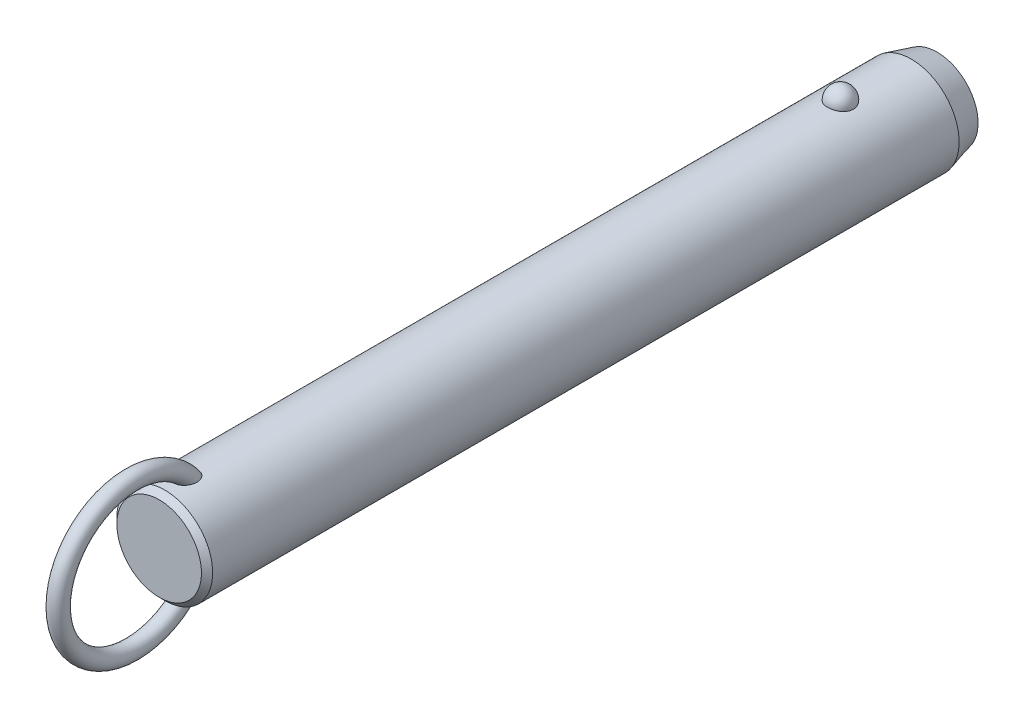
ISO-10303-21;
HEADER;
FILE_DESCRIPTION(('STEP AP214'),'2;1');
FILE_NAME('part.step','',(''),(''),'','','');
FILE_SCHEMA(('AUTOMOTIVE_DESIGN { 1 0 10303 214 1 1 1 1 }'));
ENDSEC;
DATA;
#1=APPLICATION_CONTEXT('core data for automotive mechanical design processes');
#2=APPLICATION_PROTOCOL_DEFINITION('international standard','automotive_design',2000,#1);
#3=PRODUCT_CONTEXT('',#1,'mechanical');
#4=PRODUCT('Part','Part','',(#3));
#5=PRODUCT_RELATED_PRODUCT_CATEGORY('part','',(#4));
#6=PRODUCT_DEFINITION_FORMATION('','',#4);
#7=PRODUCT_DEFINITION_CONTEXT('part definition',#1,'design');
#8=PRODUCT_DEFINITION('design','',#6,#7);
#9=PRODUCT_DEFINITION_SHAPE('','',#8);
#10=(LENGTH_UNIT() NAMED_UNIT(*) SI_UNIT(.MILLI.,.METRE.));
#11=(NAMED_UNIT(*) PLANE_ANGLE_UNIT() SI_UNIT($,.RADIAN.));
#12=(NAMED_UNIT(*) SI_UNIT($,.STERADIAN.) SOLID_ANGLE_UNIT());
#13=UNCERTAINTY_MEASURE_WITH_UNIT(LENGTH_MEASURE(1.E-05),#10,'distance_accuracy_value','');
#14=(GEOMETRIC_REPRESENTATION_CONTEXT(3) GLOBAL_UNCERTAINTY_ASSIGNED_CONTEXT((#13)) GLOBAL_UNIT_ASSIGNED_CONTEXT((#10,
#11,#12)) REPRESENTATION_CONTEXT('',''));
#15=CARTESIAN_POINT('',(0.,0.,0.));
#16=DIRECTION('',(0.,0.,1.));
#17=DIRECTION('',(1.,0.,0.));
#18=AXIS2_PLACEMENT_3D('',#15,#16,#17);
#19=CARTESIAN_POINT('',(0.,0.,142.2));
#20=DIRECTION('',(0.,0.,-1.));
#21=DIRECTION('',(-1.,0.,0.));
#22=AXIS2_PLACEMENT_3D('',#19,#20,#21);
#23=CYLINDRICAL_SURFACE('',#22,11.1);
#24=CARTESIAN_POINT('',(2.9724815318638,10.6945945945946,-3.));
#25=CARTESIAN_POINT('',(2.97247830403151,10.6945972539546,-2.83225059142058));
#26=CARTESIAN_POINT('',(2.95876598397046,10.6984356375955,-2.66445972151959));
#27=CARTESIAN_POINT('',(2.90424529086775,10.7133624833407,-2.33362381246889));
#28=CARTESIAN_POINT('',(2.8634252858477,10.7244540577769,-2.1705808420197));
#29=CARTESIAN_POINT('',(2.75573657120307,10.7526272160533,-1.85396767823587));
#30=CARTESIAN_POINT('',(2.68887937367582,10.7697061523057,-1.70039333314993));
#31=CARTESIAN_POINT('',(2.53079696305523,10.8079438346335,-1.40691598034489));
#32=CARTESIAN_POINT('',(2.43957264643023,10.8291024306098,-1.2670124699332));
#33=CARTESIAN_POINT('',(2.23458150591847,10.8732541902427,-1.00409565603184));
#34=CARTESIAN_POINT('',(2.12071295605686,10.8962553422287,-0.881162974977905));
#35=CARTESIAN_POINT('',(1.87365402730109,10.9414421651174,-0.656352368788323));
#36=CARTESIAN_POINT('',(1.74046358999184,10.9636278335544,-0.554474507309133));
#37=CARTESIAN_POINT('',(1.45872188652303,11.0046495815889,-0.374872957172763));
#38=CARTESIAN_POINT('',(1.31021276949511,11.0234944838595,-0.297085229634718));
#39=CARTESIAN_POINT('',(1.00170030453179,11.0557957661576,-0.167529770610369));
#40=CARTESIAN_POINT('',(0.841698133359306,11.0692526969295,-0.115759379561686));
#41=CARTESIAN_POINT('',(0.517607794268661,11.0890932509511,-0.0403925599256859));
#42=CARTESIAN_POINT('',(0.353633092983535,11.0955916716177,-0.0163383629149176));
#43=CARTESIAN_POINT('',(0.0238420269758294,11.1011989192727,0.0044517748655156));
#44=CARTESIAN_POINT('',(-0.141974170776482,11.1003084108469,0.00119017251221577));
#45=CARTESIAN_POINT('',(-0.468405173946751,11.0912990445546,-0.0323233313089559));
#46=CARTESIAN_POINT('',(-0.629059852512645,11.0832767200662,-0.0622147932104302));
#47=CARTESIAN_POINT('',(-0.942937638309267,11.0609962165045,-0.147645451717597));
#48=CARTESIAN_POINT('',(-1.09616062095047,11.0467379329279,-0.203185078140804));
#49=CARTESIAN_POINT('',(-1.39181061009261,11.0134071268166,-0.3387529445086));
#50=CARTESIAN_POINT('',(-1.53417383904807,10.9943086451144,-0.418913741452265));
#51=CARTESIAN_POINT('',(-1.80342160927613,10.9533667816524,-0.60144882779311));
#52=CARTESIAN_POINT('',(-1.9303046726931,10.9315231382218,-0.703825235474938));
#53=CARTESIAN_POINT('',(-2.16747598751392,10.887005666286,-0.930091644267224));
#54=CARTESIAN_POINT('',(-2.27742774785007,10.8643239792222,-1.05433291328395));
#55=CARTESIAN_POINT('',(-2.47517316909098,10.8209886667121,-1.31966633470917));
#56=CARTESIAN_POINT('',(-2.56296538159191,10.8003351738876,-1.46075958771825));
#57=CARTESIAN_POINT('',(-2.71500300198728,10.7631304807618,-1.75753646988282));
#58=CARTESIAN_POINT('',(-2.77898901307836,10.7466250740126,-1.91335887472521));
#59=CARTESIAN_POINT('',(-2.88046189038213,10.7198747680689,-2.2339152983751));
#60=CARTESIAN_POINT('',(-2.91794947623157,10.709629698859,-2.39864907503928));
#61=CARTESIAN_POINT('',(-2.96537819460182,10.6965949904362,-2.73165170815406));
#62=CARTESIAN_POINT('',(-2.97542891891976,10.693775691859,-2.89990378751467));
#63=CARTESIAN_POINT('',(-2.96804271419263,10.6958279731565,-3.235752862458));
#64=CARTESIAN_POINT('',(-2.95060646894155,10.7006993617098,-3.40334987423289));
#65=CARTESIAN_POINT('',(-2.88883358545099,10.71753912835,-3.73233906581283));
#66=CARTESIAN_POINT('',(-2.84462026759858,10.7294749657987,-3.89375610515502));
#67=CARTESIAN_POINT('',(-2.73050447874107,10.7590797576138,-4.20667949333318));
#68=CARTESIAN_POINT('',(-2.66060103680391,10.7767489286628,-4.35818546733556));
#69=CARTESIAN_POINT('',(-2.49642559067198,10.8159599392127,-4.6478542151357));
#70=CARTESIAN_POINT('',(-2.40203047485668,10.8375211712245,-4.78594458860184));
#71=CARTESIAN_POINT('',(-2.19143488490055,10.8820570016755,-5.0441038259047));
#72=CARTESIAN_POINT('',(-2.07523364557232,10.9050316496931,-5.16417205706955));
#73=CARTESIAN_POINT('',(-1.82361254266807,10.9499219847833,-5.38334833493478));
#74=CARTESIAN_POINT('',(-1.68812945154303,10.9718338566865,-5.48238464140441));
#75=CARTESIAN_POINT('',(-1.40191298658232,11.0120611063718,-5.65618873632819));
#76=CARTESIAN_POINT('',(-1.25118062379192,11.0303767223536,-5.73095813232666));
#77=CARTESIAN_POINT('',(-0.940570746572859,11.0611653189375,-5.85334725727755));
#78=CARTESIAN_POINT('',(-0.780821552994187,11.0737044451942,-5.90127578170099));
#79=CARTESIAN_POINT('',(-0.455204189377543,11.0918598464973,-5.96992976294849));
#80=CARTESIAN_POINT('',(-0.289336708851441,11.0974768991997,-5.99065827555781));
#81=CARTESIAN_POINT('',(0.0406846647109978,11.1011307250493,-6.00418773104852));
#82=CARTESIAN_POINT('',(0.204817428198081,11.099299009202,-5.99747318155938));
#83=CARTESIAN_POINT('',(0.5295530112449,11.088551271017,-5.9574031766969));
#84=CARTESIAN_POINT('',(0.69015594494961,11.0796354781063,-5.92404858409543));
#85=CARTESIAN_POINT('',(1.0027760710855,11.0557204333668,-5.83180084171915));
#86=CARTESIAN_POINT('',(1.15482001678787,11.0407414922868,-5.77299291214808));
#87=CARTESIAN_POINT('',(1.44678373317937,11.0062913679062,-5.63147366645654));
#88=CARTESIAN_POINT('',(1.58670279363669,10.9868199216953,-5.54876095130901));
#89=CARTESIAN_POINT('',(1.8527023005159,10.9451315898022,-5.36027644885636));
#90=CARTESIAN_POINT('',(1.97855158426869,10.9228788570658,-5.25418644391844));
#91=CARTESIAN_POINT('',(2.21080872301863,10.8782509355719,-5.02251354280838));
#92=CARTESIAN_POINT('',(2.31721312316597,10.8558757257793,-4.89692718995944));
#93=CARTESIAN_POINT('',(2.5094551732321,10.8130715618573,-4.62745408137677));
#94=CARTESIAN_POINT('',(2.59493284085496,10.7926798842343,-4.48330448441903));
#95=CARTESIAN_POINT('',(2.740862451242,10.7565495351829,-4.18236358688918));
#96=CARTESIAN_POINT('',(2.80132490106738,10.7408089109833,-4.02557762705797));
#97=CARTESIAN_POINT('',(2.88959070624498,10.7173718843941,-3.72475308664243));
#98=CARTESIAN_POINT('',(2.92062102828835,10.7088950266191,-3.58171216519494));
#99=CARTESIAN_POINT('',(2.96206765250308,10.6975052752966,-3.29245795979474));
#100=CARTESIAN_POINT('',(2.97248434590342,10.6945922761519,-3.14624473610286));
#101=CARTESIAN_POINT('',(2.9724815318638,10.6945945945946,-3.));
#102=B_SPLINE_CURVE_WITH_KNOTS('',3,(#24,#25,#26,#27,#28,#29,#30,#31,#32,#33,#34,#35,#36,#37,
#38,#39,#40,#41,#42,#43,#44,#45,#46,#47,#48,#49,#50,#51,#52,#53,#54,#55,#56,#57,#58,#59,#60,#61,
#62,#63,#64,#65,#66,#67,#68,#69,#70,#71,#72,#73,#74,#75,#76,#77,#78,#79,#80,#81,#82,#83,#84,#85,
#86,#87,#88,#89,#90,#91,#92,#93,#94,#95,#96,#97,#98,#99,#100,#101),.UNSPECIFIED.,.T.,.F.,(4,2,2,
2,2,2,2,2,2,2,2,2,2,2,2,2,2,2,2,2,2,2,2,2,2,2,2,2,2,2,2,2,2,2,2,2,2,2,4),(0.,0.502722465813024,
1.00566079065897,1.5083769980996,2.01107471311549,2.51608392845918,3.02109467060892,
3.52475118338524,4.02835620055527,4.523518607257,5.0186364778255,5.50715297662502,
5.9956776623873,6.48688002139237,6.97812923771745,7.47814366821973,7.9781907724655,
8.48353712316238,8.9888697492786,9.49218093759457,9.99547960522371,10.4964777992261,
10.997494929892,11.5010810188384,12.0046847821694,12.5099796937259,13.0152411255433,
13.5145635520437,14.0138298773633,14.5043200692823,14.9947943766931,15.4836390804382,
15.9725123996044,16.4685040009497,16.9645836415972,17.4686765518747,17.972557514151,
18.410841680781,18.849117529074),.UNSPECIFIED.);
#103=CARTESIAN_POINT('',(2.9724815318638,10.6945945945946,-3.));
#104=VERTEX_POINT('',#103);
#105=EDGE_CURVE('E41',#104,#104,#102,.T.);
#106=ORIENTED_EDGE('',*,*,#105,.T.);
#107=EDGE_LOOP('',(#106));
#108=FACE_BOUND('',#107,.T.);
#109=CARTESIAN_POINT('',(0.,0.,153.6));
#110=DIRECTION('',(0.,0.,1.));
#111=DIRECTION('',(1.,0.,0.));
#112=AXIS2_PLACEMENT_3D('',#109,#110,#111);
#113=CIRCLE('',#112,11.1);
#114=CARTESIAN_POINT('',(-11.1,0.,153.6));
#115=VERTEX_POINT('',#114);
#116=EDGE_CURVE('E10',#115,#115,#113,.F.);
#117=ORIENTED_EDGE('',*,*,#116,.T.);
#118=EDGE_LOOP('',(#117));
#119=FACE_BOUND('',#118,.T.);
#120=CARTESIAN_POINT('',(-0.564520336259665,-11.0856356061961,145.857815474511));
#121=CARTESIAN_POINT('',(-0.667202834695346,-11.0804062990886,145.891283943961));
#122=CARTESIAN_POINT('',(-0.766875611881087,-11.0738877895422,145.933835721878));
#123=CARTESIAN_POINT('',(-0.95728412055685,-11.0590576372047,146.035419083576));
#124=CARTESIAN_POINT('',(-1.04801616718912,-11.0507452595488,146.09445742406));
#125=CARTESIAN_POINT('',(-1.21800952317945,-11.0333016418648,146.226529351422));
#126=CARTESIAN_POINT('',(-1.2973080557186,-11.0241732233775,146.299515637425));
#127=CARTESIAN_POINT('',(-1.44337665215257,-11.0060026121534,146.457037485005));
#128=CARTESIAN_POINT('',(-1.51014622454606,-10.9969604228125,146.541573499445));
#129=CARTESIAN_POINT('',(-1.63454620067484,-10.9791841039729,146.725521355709));
#130=CARTESIAN_POINT('',(-1.69127003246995,-10.9705107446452,146.825549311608));
#131=CARTESIAN_POINT('',(-1.7898078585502,-10.9548648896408,147.032790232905));
#132=CARTESIAN_POINT('',(-1.83161214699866,-10.9478935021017,147.140007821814));
#133=CARTESIAN_POINT('',(-1.91557028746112,-10.9335803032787,147.405408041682));
#134=CARTESIAN_POINT('',(-1.95040620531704,-10.9273269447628,147.565980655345));
#135=CARTESIAN_POINT('',(-1.99388326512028,-10.9194709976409,147.890697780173));
#136=CARTESIAN_POINT('',(-2.00248051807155,-10.9178762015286,148.054847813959));
#137=CARTESIAN_POINT('',(-1.99551615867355,-10.9191578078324,148.424650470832));
#138=CARTESIAN_POINT('',(-1.9732206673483,-10.9232807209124,148.630191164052));
#139=CARTESIAN_POINT('',(-1.9152976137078,-10.9335244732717,148.933595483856));
#140=CARTESIAN_POINT('',(-1.89184575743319,-10.9376266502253,149.034088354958));
#141=CARTESIAN_POINT('',(-1.83700674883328,-10.9469720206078,149.232855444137));
#142=CARTESIAN_POINT('',(-1.80562070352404,-10.9522150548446,149.331129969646));
#143=CARTESIAN_POINT('',(-1.73463055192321,-10.9636837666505,149.525914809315));
#144=CARTESIAN_POINT('',(-1.69493416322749,-10.9699202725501,149.622390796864));
#145=CARTESIAN_POINT('',(-1.60745141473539,-10.9830806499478,149.811626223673));
#146=CARTESIAN_POINT('',(-1.55966150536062,-10.9900048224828,149.904384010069));
#147=CARTESIAN_POINT('',(-1.45591812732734,-11.0042280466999,150.084690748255));
#148=CARTESIAN_POINT('',(-1.40000013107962,-11.0115253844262,150.172260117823));
#149=CARTESIAN_POINT('',(-1.27937470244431,-11.0261911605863,150.341029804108));
#150=CARTESIAN_POINT('',(-1.21467835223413,-11.0335594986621,150.42223795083));
#151=CARTESIAN_POINT('',(-1.08218150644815,-11.0473027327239,150.569001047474));
#152=CARTESIAN_POINT('',(-1.01522633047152,-11.0537063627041,150.635309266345));
#153=CARTESIAN_POINT('',(-0.872952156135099,-11.065850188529,150.758378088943));
#154=CARTESIAN_POINT('',(-0.797642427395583,-11.0715911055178,150.815149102));
#155=CARTESIAN_POINT('',(-0.651396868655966,-11.081071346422,150.907515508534));
#156=CARTESIAN_POINT('',(-0.581712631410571,-11.0849841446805,150.945049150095));
#157=CARTESIAN_POINT('',(-0.437066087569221,-11.0916271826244,151.008259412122));
#158=CARTESIAN_POINT('',(-0.362109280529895,-11.0943586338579,151.033948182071));
#159=CARTESIAN_POINT('',(-0.207828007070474,-11.0983242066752,151.071117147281));
#160=CARTESIAN_POINT('',(-0.12846771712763,-11.0995432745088,151.082454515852));
#161=CARTESIAN_POINT('',(0.0309101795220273,-11.1002423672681,151.088965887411));
#162=CARTESIAN_POINT('',(0.110927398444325,-11.0997233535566,151.084148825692));
#163=CARTESIAN_POINT('',(0.25640659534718,-11.097240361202,151.060959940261));
#164=CARTESIAN_POINT('',(0.322235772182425,-11.0955074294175,151.044754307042));
#165=CARTESIAN_POINT('',(0.450635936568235,-11.0910350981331,151.002600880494));
#166=CARTESIAN_POINT('',(0.513205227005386,-11.0882951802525,150.976648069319));
#167=CARTESIAN_POINT('',(0.662626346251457,-11.0805620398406,150.902607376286));
#168=CARTESIAN_POINT('',(0.747127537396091,-11.0751144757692,150.849845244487));
#169=CARTESIAN_POINT('',(0.906756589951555,-11.0631932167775,150.731720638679));
#170=CARTESIAN_POINT('',(0.981859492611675,-11.0567168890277,150.666325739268));
#171=CARTESIAN_POINT('',(1.10712207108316,-11.0447856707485,150.54226337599));
#172=CARTESIAN_POINT('',(1.15909566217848,-11.0394280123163,150.485383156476));
#173=CARTESIAN_POINT('',(1.25791923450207,-11.0286040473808,150.367327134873));
#174=CARTESIAN_POINT('',(1.30476642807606,-11.0231376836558,150.306149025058));
#175=CARTESIAN_POINT('',(1.43818612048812,-11.0068027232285,150.117305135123));
#176=CARTESIAN_POINT('',(1.51751767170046,-10.9960104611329,149.984453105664));
#177=CARTESIAN_POINT('',(1.63597546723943,-10.9788847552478,149.753137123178));
#178=CARTESIAN_POINT('',(1.67988876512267,-10.9722190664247,149.657053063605));
#179=CARTESIAN_POINT('',(1.75953241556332,-10.9597298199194,149.461431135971));
#180=CARTESIAN_POINT('',(1.7952596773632,-10.9539065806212,149.361891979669));
#181=CARTESIAN_POINT('',(1.85844731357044,-10.9433632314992,149.16021118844));
#182=CARTESIAN_POINT('',(1.88591073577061,-10.9386427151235,149.05807052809));
#183=CARTESIAN_POINT('',(1.93234324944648,-10.9305350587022,148.851819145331));
#184=CARTESIAN_POINT('',(1.95131065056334,-10.9271481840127,148.747708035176));
#185=CARTESIAN_POINT('',(1.9904020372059,-10.9201183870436,148.465458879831));
#186=CARTESIAN_POINT('',(2.00221217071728,-10.9179256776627,148.286037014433));
#187=CARTESIAN_POINT('',(1.99711676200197,-10.9188636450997,147.927713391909));
#188=CARTESIAN_POINT('',(1.98026150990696,-10.9219849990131,147.748811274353));
#189=CARTESIAN_POINT('',(1.92151657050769,-10.9324473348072,147.43645144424));
#190=CARTESIAN_POINT('',(1.88605081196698,-10.9386915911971,147.301759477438));
#191=CARTESIAN_POINT('',(1.79393020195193,-10.9541780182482,147.039966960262));
#192=CARTESIAN_POINT('',(1.73729868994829,-10.9634168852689,146.912858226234));
#193=CARTESIAN_POINT('',(1.61237037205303,-10.9824218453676,146.689418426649));
#194=CARTESIAN_POINT('',(1.54715374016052,-10.9918945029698,146.591345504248));
#195=CARTESIAN_POINT('',(1.40127026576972,-11.0114415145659,146.407434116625));
#196=CARTESIAN_POINT('',(1.32060742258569,-11.0215157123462,146.321592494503));
#197=CARTESIAN_POINT('',(1.1447478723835,-11.041168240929,146.165163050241));
#198=CARTESIAN_POINT('',(1.04947805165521,-11.0507437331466,146.094656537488));
#199=CARTESIAN_POINT('',(0.847278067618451,-11.0680789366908,145.972640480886));
#200=CARTESIAN_POINT('',(0.74035174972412,-11.0758392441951,145.921124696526));
#201=CARTESIAN_POINT('',(0.529289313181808,-11.0878275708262,145.843485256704));
#202=CARTESIAN_POINT('',(0.425895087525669,-11.0923259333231,145.815377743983));
#203=CARTESIAN_POINT('',(0.215723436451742,-11.0984001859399,145.777703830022));
#204=CARTESIAN_POINT('',(0.108947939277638,-11.0999777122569,145.768127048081));
#205=CARTESIAN_POINT('',(-0.0938962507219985,-11.1000196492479,145.767877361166));
#206=CARTESIAN_POINT('',(-0.189967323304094,-11.0987797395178,145.775408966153));
#207=CARTESIAN_POINT('',(-0.379657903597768,-11.0939111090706,145.805507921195));
#208=CARTESIAN_POINT('',(-0.47327735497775,-11.0902823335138,145.828075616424));
#209=CARTESIAN_POINT('',(-0.564520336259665,-11.0856356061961,145.857815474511));
#210=B_SPLINE_CURVE_WITH_KNOTS('',3,(#120,#121,#122,#123,#124,#125,#126,#127,#128,#129,#130,
#131,#132,#133,#134,#135,#136,#137,#138,#139,#140,#141,#142,#143,#144,#145,#146,#147,#148,#149,
#150,#151,#152,#153,#154,#155,#156,#157,#158,#159,#160,#161,#162,#163,#164,#165,#166,#167,#168,
#169,#170,#171,#172,#173,#174,#175,#176,#177,#178,#179,#180,#181,#182,#183,#184,#185,#186,#187,
#188,#189,#190,#191,#192,#193,#194,#195,#196,#197,#198,#199,#200,#201,#202,#203,#204,#205,#206,
#207,#208,#209),.UNSPECIFIED.,.T.,.F.,(4,2,2,2,2,2,2,2,2,2,2,2,2,2,2,2,2,2,2,2,2,2,2,2,2,2,2,2,
2,2,2,2,2,2,2,2,2,2,2,2,2,2,2,2,4),(0.,0.323999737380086,0.64813245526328,0.971184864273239,
1.29424994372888,1.63886237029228,1.98369857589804,2.47426059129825,2.96564271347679,
3.58257396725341,3.89215258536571,4.20168803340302,4.51486273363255,4.82817514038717,
5.14015911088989,5.45175282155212,5.73442856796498,6.01679375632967,6.2536458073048,
6.49025437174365,6.72919963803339,6.96801276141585,7.17061258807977,7.37331685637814,
7.67094989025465,7.96935728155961,8.20075067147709,8.4322692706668,8.89581623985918,
9.21306533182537,9.53043400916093,9.84768549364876,10.1650000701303,10.7022930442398,
11.2386443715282,11.655339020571,12.071575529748,12.4245637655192,12.7774607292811,
13.1321855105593,13.4867936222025,13.8068771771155,14.1267813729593,14.4146787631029,
14.7025827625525),.UNSPECIFIED.);
#211=CARTESIAN_POINT('',(-0.564520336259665,-11.0856356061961,145.857815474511));
#212=VERTEX_POINT('',#211);
#213=EDGE_CURVE('E59',#212,#212,#210,.T.);
#214=ORIENTED_EDGE('',*,*,#213,.T.);
#215=EDGE_LOOP('',(#214));
#216=FACE_BOUND('',#215,.T.);
#217=CARTESIAN_POINT('',(-0.564520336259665,11.0856356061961,145.857815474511));
#218=CARTESIAN_POINT('',(-0.468542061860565,11.0905203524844,145.826545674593));
#219=CARTESIAN_POINT('',(-0.369793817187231,11.0942886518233,145.803157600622));
#220=CARTESIAN_POINT('',(-0.169555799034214,11.0991586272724,145.773085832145));
#221=CARTESIAN_POINT('',(-0.0680604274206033,11.1002543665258,145.76643932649));
#222=CARTESIAN_POINT('',(0.134549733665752,11.099646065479,145.770157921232));
#223=CARTESIAN_POINT('',(0.235664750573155,11.0979441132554,145.78051033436));
#224=CARTESIAN_POINT('',(0.434632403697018,11.0919342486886,145.817831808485));
#225=CARTESIAN_POINT('',(0.532486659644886,11.0876276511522,145.844792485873));
#226=CARTESIAN_POINT('',(0.722445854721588,11.0768742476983,145.9144096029));
#227=CARTESIAN_POINT('',(0.814543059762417,11.0704246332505,145.957086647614));
#228=CARTESIAN_POINT('',(0.990565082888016,11.0560659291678,146.056648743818));
#229=CARTESIAN_POINT('',(1.07448844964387,11.048156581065,146.113536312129));
#230=CARTESIAN_POINT('',(1.23562672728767,11.0313221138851,146.242210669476));
#231=CARTESIAN_POINT('',(1.3124268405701,11.0223686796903,146.314511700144));
#232=CARTESIAN_POINT('',(1.45398030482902,11.0045918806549,146.470042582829));
#233=CARTESIAN_POINT('',(1.51873073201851,10.9957685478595,146.553275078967));
#234=CARTESIAN_POINT('',(1.64107232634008,10.9782087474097,146.736384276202));
#235=CARTESIAN_POINT('',(1.6974317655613,10.9695572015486,146.837089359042));
#236=CARTESIAN_POINT('',(1.79515063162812,10.9539887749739,147.045626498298));
#237=CARTESIAN_POINT('',(1.83649966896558,10.9470730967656,147.15346343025));
#238=CARTESIAN_POINT('',(1.91931148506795,10.9329211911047,147.420399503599));
#239=CARTESIAN_POINT('',(1.95340104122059,10.9267904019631,147.581861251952));
#240=CARTESIAN_POINT('',(1.99526195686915,10.9192174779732,147.90821631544));
#241=CARTESIAN_POINT('',(2.00298989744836,10.9177830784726,148.07311484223));
#242=CARTESIAN_POINT('',(1.99396251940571,10.9194420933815,148.444100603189));
#243=CARTESIAN_POINT('',(1.97050829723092,10.923774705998,148.65003871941));
#244=CARTESIAN_POINT('',(1.91079643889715,10.9343131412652,148.953901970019));
#245=CARTESIAN_POINT('',(1.88673702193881,10.9385106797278,149.054529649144));
#246=CARTESIAN_POINT('',(1.8306550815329,10.9480376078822,149.253510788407));
#247=CARTESIAN_POINT('',(1.79863369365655,10.9533668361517,149.351864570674));
#248=CARTESIAN_POINT('',(1.72633365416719,10.9649954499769,149.546720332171));
#249=CARTESIAN_POINT('',(1.68596409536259,10.9713053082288,149.64318790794));
#250=CARTESIAN_POINT('',(1.59707998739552,10.9845964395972,149.832323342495));
#251=CARTESIAN_POINT('',(1.54856169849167,10.9915780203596,149.924989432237));
#252=CARTESIAN_POINT('',(1.44330168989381,11.0058935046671,150.104975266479));
#253=CARTESIAN_POINT('',(1.3865974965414,11.0132257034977,150.192316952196));
#254=CARTESIAN_POINT('',(1.26431158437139,11.0279330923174,150.360456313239));
#255=CARTESIAN_POINT('',(1.19874160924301,11.0353082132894,150.441262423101));
#256=CARTESIAN_POINT('',(1.06542088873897,11.048931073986,150.585985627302));
#257=CARTESIAN_POINT('',(0.998640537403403,11.0552153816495,150.650784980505));
#258=CARTESIAN_POINT('',(0.856896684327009,11.0671032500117,150.770846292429));
#259=CARTESIAN_POINT('',(0.781942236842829,11.0727075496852,150.826118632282));
#260=CARTESIAN_POINT('',(0.636276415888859,11.081949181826,150.915972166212));
#261=CARTESIAN_POINT('',(0.566755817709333,11.0857572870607,150.952441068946));
#262=CARTESIAN_POINT('',(0.422602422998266,11.0921860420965,151.013533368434));
#263=CARTESIAN_POINT('',(0.347974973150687,11.0948079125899,151.038168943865));
#264=CARTESIAN_POINT('',(0.194593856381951,11.0985608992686,151.073323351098));
#265=CARTESIAN_POINT('',(0.115807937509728,11.0996777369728,151.083706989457));
#266=CARTESIAN_POINT('',(-0.0422499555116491,11.1002003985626,151.088574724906));
#267=CARTESIAN_POINT('',(-0.121521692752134,11.09960699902,151.083066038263));
#268=CARTESIAN_POINT('',(-0.266046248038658,11.0970123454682,151.058827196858));
#269=CARTESIAN_POINT('',(-0.331661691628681,11.0952283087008,151.042135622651));
#270=CARTESIAN_POINT('',(-0.459588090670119,11.0906663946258,150.999111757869));
#271=CARTESIAN_POINT('',(-0.52189737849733,11.0878880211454,150.972774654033));
#272=CARTESIAN_POINT('',(-0.671446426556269,11.0800342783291,150.897513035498));
#273=CARTESIAN_POINT('',(-0.756250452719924,11.0744969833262,150.843818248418));
#274=CARTESIAN_POINT('',(-0.916349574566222,11.0624045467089,150.723802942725));
#275=CARTESIAN_POINT('',(-0.991618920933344,11.0558467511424,150.657449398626));
#276=CARTESIAN_POINT('',(-1.11713140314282,11.0437783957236,150.531633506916));
#277=CARTESIAN_POINT('',(-1.16920539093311,11.0383619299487,150.473952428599));
#278=CARTESIAN_POINT('',(-1.2681747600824,11.02743010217,150.354280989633));
#279=CARTESIAN_POINT('',(-1.31506731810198,11.0219146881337,150.292288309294));
#280=CARTESIAN_POINT('',(-1.40399813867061,11.0109399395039,150.164784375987));
#281=CARTESIAN_POINT('',(-1.44602864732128,11.0054807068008,150.099267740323));
#282=CARTESIAN_POINT('',(-1.52538779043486,10.9947621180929,149.965422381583));
#283=CARTESIAN_POINT('',(-1.56271516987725,10.9895028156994,149.897092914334));
#284=CARTESIAN_POINT('',(-1.64537943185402,10.9774790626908,149.733210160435));
#285=CARTESIAN_POINT('',(-1.68879497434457,10.9708503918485,149.6366735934));
#286=CARTESIAN_POINT('',(-1.76740738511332,10.9584602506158,149.440236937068));
#287=CARTESIAN_POINT('',(-1.80260120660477,10.95269910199,149.34033561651));
#288=CARTESIAN_POINT('',(-1.86468657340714,10.9423003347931,149.137966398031));
#289=CARTESIAN_POINT('',(-1.8915816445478,10.9376622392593,149.035499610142));
#290=CARTESIAN_POINT('',(-1.93682458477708,10.9297405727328,148.828642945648));
#291=CARTESIAN_POINT('',(-1.95517082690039,10.9264572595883,148.724252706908));
#292=CARTESIAN_POINT('',(-1.99232562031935,10.9197647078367,148.44262876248));
#293=CARTESIAN_POINT('',(-2.00294603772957,10.9177914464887,148.264185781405));
#294=CARTESIAN_POINT('',(-1.99566675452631,10.9191290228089,147.907996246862));
#295=CARTESIAN_POINT('',(-1.97781651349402,10.9224306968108,147.73024902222));
#296=CARTESIAN_POINT('',(-1.91747214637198,10.9331592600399,147.419792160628));
#297=CARTESIAN_POINT('',(-1.88131022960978,10.9395108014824,147.285825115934));
#298=CARTESIAN_POINT('',(-1.78790380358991,10.9551659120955,147.02559757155));
#299=CARTESIAN_POINT('',(-1.73068309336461,10.9644661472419,146.899328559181));
#300=CARTESIAN_POINT('',(-1.60475573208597,10.9835398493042,146.67741565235));
#301=CARTESIAN_POINT('',(-1.53908879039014,10.9930297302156,146.580026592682));
#302=CARTESIAN_POINT('',(-1.39238608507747,11.0125708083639,146.397525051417));
#303=CARTESIAN_POINT('',(-1.31135150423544,11.0226219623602,146.312411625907));
#304=CARTESIAN_POINT('',(-1.14382035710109,11.0411991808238,146.16529943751));
#305=CARTESIAN_POINT('',(-1.0585850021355,11.0497792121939,146.10186930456));
#306=CARTESIAN_POINT('',(-0.878723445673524,11.0655285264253,145.990250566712));
#307=CARTESIAN_POINT('',(-0.784123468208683,11.0727015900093,145.942020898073));
#308=CARTESIAN_POINT('',(-0.646163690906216,11.0812501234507,145.886023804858));
#309=CARTESIAN_POINT('',(-0.605595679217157,11.0835451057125,145.871197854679));
#310=CARTESIAN_POINT('',(-0.564520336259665,11.0856356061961,145.857815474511));
#311=B_SPLINE_CURVE_WITH_KNOTS('',3,(#217,#218,#219,#220,#221,#222,#223,#224,#225,#226,#227,
#228,#229,#230,#231,#232,#233,#234,#235,#236,#237,#238,#239,#240,#241,#242,#243,#244,#245,#246,
#247,#248,#249,#250,#251,#252,#253,#254,#255,#256,#257,#258,#259,#260,#261,#262,#263,#264,#265,
#266,#267,#268,#269,#270,#271,#272,#273,#274,#275,#276,#277,#278,#279,#280,#281,#282,#283,#284,
#285,#286,#287,#288,#289,#290,#291,#292,#293,#294,#295,#296,#297,#298,#299,#300,#301,#302,#303,
#304,#305,#306,#307,#308,#309,#310),.UNSPECIFIED.,.T.,.F.,(4,2,2,2,2,2,2,2,2,2,2,2,2,2,2,2,2,2,
2,2,2,2,2,2,2,2,2,2,2,2,2,2,2,2,2,2,2,2,2,2,2,2,2,2,2,2,4),(0.,0.303061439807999,
0.606795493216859,0.910302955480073,1.21365733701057,1.51741085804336,1.82121821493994,
2.13745205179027,2.45376252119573,2.79958678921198,3.14564996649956,3.63832391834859,
4.13180893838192,4.75031912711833,5.06071926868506,5.37107516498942,5.6850077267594,
5.99908475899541,6.31176519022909,6.62403542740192,6.90315673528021,7.18197194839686,
7.41687778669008,7.65154134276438,7.88841587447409,8.12518286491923,8.32752842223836,
8.52997509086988,8.82986421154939,9.13054668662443,9.3639350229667,9.5974499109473,
9.83133221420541,10.0652767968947,10.383032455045,10.7009056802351,11.0186436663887,
11.3364420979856,11.8705925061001,12.4038159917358,12.8189662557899,13.2336487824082,
13.5857049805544,13.9377340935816,14.2561354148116,14.5736690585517,14.7033687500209),.UNSPECIFIED.);
#312=CARTESIAN_POINT('',(-0.564520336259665,11.0856356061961,145.857815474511));
#313=VERTEX_POINT('',#312);
#314=EDGE_CURVE('E67',#313,#313,#311,.T.);
#315=ORIENTED_EDGE('',*,*,#314,.T.);
#316=EDGE_LOOP('',(#315));
#317=FACE_BOUND('',#316,.T.);
#318=CARTESIAN_POINT('',(0.,0.,-19.3999999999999));
#319=DIRECTION('',(0.,0.,-1.));
#320=DIRECTION('',(-1.,0.,0.));
#321=AXIS2_PLACEMENT_3D('',#318,#319,#320);
#322=CIRCLE('',#321,11.1);
#323=CARTESIAN_POINT('',(-11.1,0.,-19.3999999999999));
#324=VERTEX_POINT('',#323);
#325=EDGE_CURVE('E56',#324,#324,#322,.F.);
#326=ORIENTED_EDGE('',*,*,#325,.T.);
#327=EDGE_LOOP('',(#326));
#328=FACE_BOUND('',#327,.T.);
#329=ADVANCED_FACE('F37',(#108,#119,#216,#317,#328),#23,.T.);
#330=CARTESIAN_POINT('',(0.,0.,-25.4));
#331=DIRECTION('',(0.,0.,-1.));
#332=DIRECTION('',(-1.,0.,0.));
#333=AXIS2_PLACEMENT_3D('',#330,#331,#332);
#334=PLANE('',#333);
#335=CARTESIAN_POINT('',(0.,0.,-25.4));
#336=DIRECTION('',(0.,0.,-1.));
#337=DIRECTION('',(-1.,0.,0.));
#338=AXIS2_PLACEMENT_3D('',#335,#336,#337);
#339=CIRCLE('',#338,9.49230484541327);
#340=CARTESIAN_POINT('',(-9.49230484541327,0.,-25.4));
#341=VERTEX_POINT('',#340);
#342=EDGE_CURVE('E66',#341,#341,#339,.T.);
#343=ORIENTED_EDGE('',*,*,#342,.T.);
#344=EDGE_LOOP('',(#343));
#345=FACE_BOUND('',#344,.T.);
#346=ADVANCED_FACE('F85',(#345),#334,.T.);
#347=CARTESIAN_POINT('',(0.,0.,-25.4));
#348=DIRECTION('',(0.,0.,1.));
#349=DIRECTION('',(1.,0.,0.));
#350=AXIS2_PLACEMENT_3D('',#347,#348,#349);
#351=CONICAL_SURFACE('',#350,9.49230484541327,0.261799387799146);
#352=ORIENTED_EDGE('',*,*,#325,.F.);
#353=EDGE_LOOP('',(#352));
#354=FACE_BOUND('',#353,.T.);
#355=ORIENTED_EDGE('',*,*,#342,.F.);
#356=EDGE_LOOP('',(#355));
#357=FACE_BOUND('',#356,.T.);
#358=ADVANCED_FACE('F83',(#354,#357),#351,.T.);
#359=CARTESIAN_POINT('',(0.,0.,154.9));
#360=DIRECTION('',(0.,0.,1.));
#361=DIRECTION('',(1.,0.,0.));
#362=AXIS2_PLACEMENT_3D('',#359,#360,#361);
#363=PLANE('',#362);
#364=CARTESIAN_POINT('',(0.,0.,154.9));
#365=DIRECTION('',(0.,0.,1.));
#366=DIRECTION('',(1.,0.,0.));
#367=AXIS2_PLACEMENT_3D('',#364,#365,#366);
#368=CIRCLE('',#367,9.80000000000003);
#369=CARTESIAN_POINT('',(-9.80000000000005,0.,154.9));
#370=VERTEX_POINT('',#369);
#371=EDGE_CURVE('E50',#370,#370,#368,.T.);
#372=ORIENTED_EDGE('',*,*,#371,.T.);
#373=EDGE_LOOP('',(#372));
#374=FACE_BOUND('',#373,.T.);
#375=ADVANCED_FACE('F77',(#374),#363,.T.);
#376=CARTESIAN_POINT('',(0.,0.,161.25));
#377=DIRECTION('',(1.,0.,0.));
#378=DIRECTION('',(0.,0.,-1.));
#379=AXIS2_PLACEMENT_3D('',#376,#377,#378);
#380=TOROIDAL_SURFACE('',#379,17.05,2.);
#381=ORIENTED_EDGE('',*,*,#314,.F.);
#382=EDGE_LOOP('',(#381));
#383=FACE_BOUND('',#382,.T.);
#384=ORIENTED_EDGE('',*,*,#213,.F.);
#385=EDGE_LOOP('',(#384));
#386=FACE_BOUND('',#385,.T.);
#387=ADVANCED_FACE('F73',(#383,#386),#380,.T.);
#388=CARTESIAN_POINT('',(0.,0.,154.9));
#389=DIRECTION('',(0.,0.,-1.));
#390=DIRECTION('',(-1.,0.,0.));
#391=AXIS2_PLACEMENT_3D('',#388,#389,#390);
#392=CONICAL_SURFACE('',#391,9.80000000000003,0.785398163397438);
#393=CARTESIAN_POINT('',(-11.1,0.,153.6));
#394=CARTESIAN_POINT('',(-11.0864583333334,0.,153.613541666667));
#395=CARTESIAN_POINT('',(-11.0729166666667,0.,153.627083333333));
#396=CARTESIAN_POINT('',(-11.0458333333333,0.,153.654166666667));
#397=CARTESIAN_POINT('',(-11.0322916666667,0.,153.667708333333));
#398=CARTESIAN_POINT('',(-11.0052083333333,0.,153.694791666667));
#399=CARTESIAN_POINT('',(-10.9916666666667,0.,153.708333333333));
#400=CARTESIAN_POINT('',(-10.9645833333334,0.,153.735416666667));
#401=CARTESIAN_POINT('',(-10.9510416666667,0.,153.748958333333));
#402=CARTESIAN_POINT('',(-10.9239583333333,0.,153.776041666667));
#403=CARTESIAN_POINT('',(-10.9104166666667,0.,153.789583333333));
#404=CARTESIAN_POINT('',(-10.8833333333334,0.,153.816666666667));
#405=CARTESIAN_POINT('',(-10.8697916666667,0.,153.830208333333));
#406=CARTESIAN_POINT('',(-10.8427083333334,0.,153.857291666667));
#407=CARTESIAN_POINT('',(-10.8291666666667,0.,153.870833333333));
#408=CARTESIAN_POINT('',(-10.8020833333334,0.,153.897916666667));
#409=CARTESIAN_POINT('',(-10.7885416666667,0.,153.911458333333));
#410=CARTESIAN_POINT('',(-10.7614583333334,0.,153.938541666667));
#411=CARTESIAN_POINT('',(-10.7479166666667,0.,153.952083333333));
#412=CARTESIAN_POINT('',(-10.7208333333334,0.,153.979166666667));
#413=CARTESIAN_POINT('',(-10.7072916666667,0.,153.992708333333));
#414=CARTESIAN_POINT('',(-10.6802083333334,0.,154.019791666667));
#415=CARTESIAN_POINT('',(-10.6666666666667,0.,154.033333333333));
#416=CARTESIAN_POINT('',(-10.6395833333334,0.,154.060416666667));
#417=CARTESIAN_POINT('',(-10.6260416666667,0.,154.073958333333));
#418=CARTESIAN_POINT('',(-10.5989583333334,0.,154.101041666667));
#419=CARTESIAN_POINT('',(-10.5854166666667,0.,154.114583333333));
#420=CARTESIAN_POINT('',(-10.5583333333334,0.,154.141666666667));
#421=CARTESIAN_POINT('',(-10.5447916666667,0.,154.155208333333));
#422=CARTESIAN_POINT('',(-10.5177083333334,0.,154.182291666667));
#423=CARTESIAN_POINT('',(-10.5041666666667,0.,154.195833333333));
#424=CARTESIAN_POINT('',(-10.4770833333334,0.,154.222916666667));
#425=CARTESIAN_POINT('',(-10.4635416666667,0.,154.236458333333));
#426=CARTESIAN_POINT('',(-10.4364583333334,0.,154.263541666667));
#427=CARTESIAN_POINT('',(-10.4229166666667,0.,154.277083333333));
#428=CARTESIAN_POINT('',(-10.3958333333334,0.,154.304166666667));
#429=CARTESIAN_POINT('',(-10.3822916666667,0.,154.317708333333));
#430=CARTESIAN_POINT('',(-10.3552083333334,0.,154.344791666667));
#431=CARTESIAN_POINT('',(-10.3416666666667,0.,154.358333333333));
#432=CARTESIAN_POINT('',(-10.3145833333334,0.,154.385416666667));
#433=CARTESIAN_POINT('',(-10.3010416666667,0.,154.398958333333));
#434=CARTESIAN_POINT('',(-10.2739583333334,0.,154.426041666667));
#435=CARTESIAN_POINT('',(-10.2604166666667,0.,154.439583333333));
#436=CARTESIAN_POINT('',(-10.2333333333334,0.,154.466666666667));
#437=CARTESIAN_POINT('',(-10.2197916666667,0.,154.480208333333));
#438=CARTESIAN_POINT('',(-10.1927083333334,0.,154.507291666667));
#439=CARTESIAN_POINT('',(-10.1791666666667,0.,154.520833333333));
#440=CARTESIAN_POINT('',(-10.1520833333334,0.,154.547916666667));
#441=CARTESIAN_POINT('',(-10.1385416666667,0.,154.561458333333));
#442=CARTESIAN_POINT('',(-10.1114583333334,0.,154.588541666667));
#443=CARTESIAN_POINT('',(-10.0979166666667,0.,154.602083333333));
#444=CARTESIAN_POINT('',(-10.0708333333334,0.,154.629166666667));
#445=CARTESIAN_POINT('',(-10.0572916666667,0.,154.642708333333));
#446=CARTESIAN_POINT('',(-10.0302083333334,0.,154.669791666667));
#447=CARTESIAN_POINT('',(-10.0166666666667,0.,154.683333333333));
#448=CARTESIAN_POINT('',(-9.98958333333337,0.,154.710416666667));
#449=CARTESIAN_POINT('',(-9.97604166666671,0.,154.723958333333));
#450=CARTESIAN_POINT('',(-9.94895833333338,0.,154.751041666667));
#451=CARTESIAN_POINT('',(-9.93541666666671,0.,154.764583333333));
#452=CARTESIAN_POINT('',(-9.90833333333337,0.,154.791666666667));
#453=CARTESIAN_POINT('',(-9.89479166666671,0.,154.805208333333));
#454=CARTESIAN_POINT('',(-9.86770833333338,0.,154.832291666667));
#455=CARTESIAN_POINT('',(-9.85416666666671,0.,154.845833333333));
#456=CARTESIAN_POINT('',(-9.82708333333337,0.,154.872916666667));
#457=CARTESIAN_POINT('',(-9.8135416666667,0.,154.886458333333));
#458=CARTESIAN_POINT('',(-9.80000000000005,0.,154.9));
#459=B_SPLINE_CURVE_WITH_KNOTS('',3,(#393,#394,#395,#396,#397,#398,#399,#400,#401,#402,#403,
#404,#405,#406,#407,#408,#409,#410,#411,#412,#413,#414,#415,#416,#417,#418,#419,#420,#421,#422,
#423,#424,#425,#426,#427,#428,#429,#430,#431,#432,#433,#434,#435,#436,#437,#438,#439,#440,#441,
#442,#443,#444,#445,#446,#447,#448,#449,#450,#451,#452,#453,#454,#455,#456,#457,#458),
.UNSPECIFIED.,.F.,.F.,(4,2,2,2,2,2,2,2,2,2,2,2,2,2,2,2,2,2,2,2,2,2,2,2,2,2,2,2,2,2,2,2,4),(0.,
0.0574524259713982,0.114904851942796,0.172357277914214,0.229809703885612,0.28726212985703,
0.344714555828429,0.402166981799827,0.459619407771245,0.517071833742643,0.574524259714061,
0.631976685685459,0.689429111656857,0.746881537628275,0.804333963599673,0.861786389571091,
0.91923881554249,0.976691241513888,1.03414366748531,1.0915960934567,1.14904851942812,
1.20650094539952,1.26395337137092,1.32140579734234,1.37885822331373,1.43631064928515,
1.49376307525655,1.55121550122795,1.60866792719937,1.66612035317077,1.72357277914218,
1.78102520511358,1.838477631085),.UNSPECIFIED.);
#460=EDGE_CURVE('BSEAM39',#115,#370,#459,.T.);
#461=ORIENTED_EDGE('',*,*,#116,.F.);
#462=ORIENTED_EDGE('',*,*,#371,.F.);
#463=ORIENTED_EDGE('',*,*,#460,.T.);
#464=ORIENTED_EDGE('',*,*,#460,.F.);
#465=EDGE_LOOP('',(#461,#463,#462,#464));
#466=FACE_BOUND('',#465,.T.);
#467=ADVANCED_FACE('F39',(#466),#392,.T.);
#468=CARTESIAN_POINT('',(0.,11.1,-3.));
#469=DIRECTION('',(0.,1.,0.));
#470=DIRECTION('',(0.,0.,-1.));
#471=AXIS2_PLACEMENT_3D('',#468,#469,#470);
#472=SPHERICAL_SURFACE('',#471,3.);
#473=ORIENTED_EDGE('',*,*,#105,.F.);
#474=EDGE_LOOP('',(#473));
#475=FACE_BOUND('',#474,.T.);
#476=ADVANCED_FACE('F79',(#475),#472,.T.);
#477=CLOSED_SHELL('',(#329,#346,#358,#375,#387,#467,#476));
#478=MANIFOLD_SOLID_BREP('B2',#477);
#479=ADVANCED_BREP_SHAPE_REPRESENTATION('',(#18,#478),#14);
#480=SHAPE_DEFINITION_REPRESENTATION(#9,#479);
ENDSEC;
END-ISO-10303-21;
